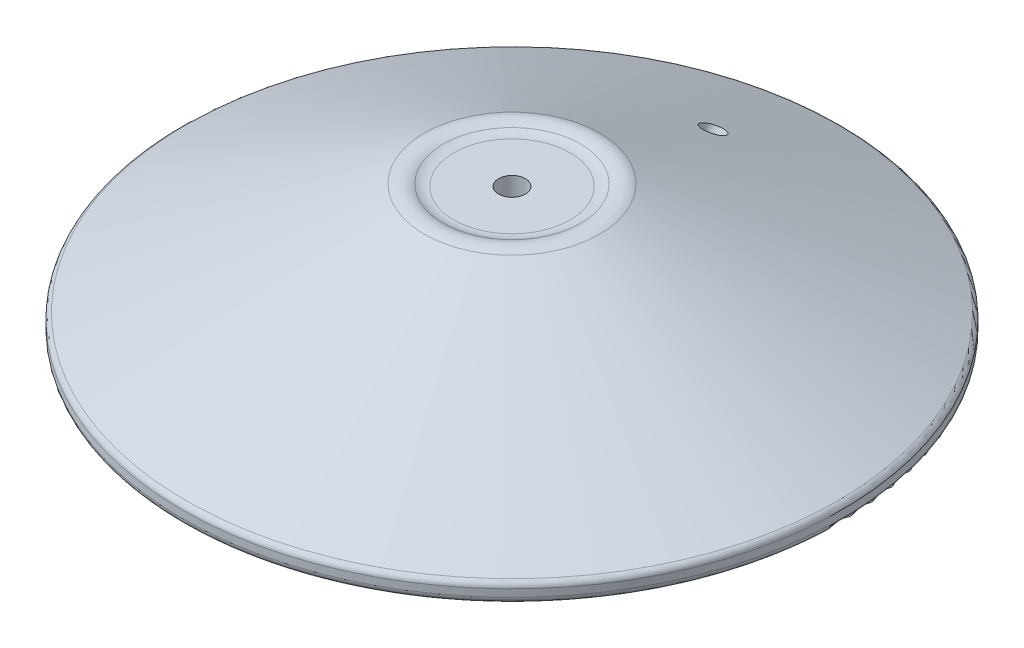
from build123d import *

# Parameters (mm, degrees)
DIAM_TRE_DU_PER_AGE_10_0_10_1_D     = 10
DIAM_TRE_DU_PER_AGE_10_0_10_1_DEPTH = 10
DIAM_TRE_DU_PER_AGE_10_0_10_1_TIP   = 3.004303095
CHANFREIN1_SIZE                     = 3


with BuildPart() as part:
    # Esquisse1 → R_volution1 (revolve)
    with BuildSketch(Plane.XY, mode=Mode.PRIVATE) as r_volution1_sk:
        with BuildLine():
            Line((6, 0), (144.5, 0))
            ThreePointArc((144.5, 0), (146.621320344, 0.878679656), (147.5, 3))
            Line((147.5, 3), (147.5, 6.284779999))
            ThreePointArc((147.5, 6.284779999), (147.032518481, 7.892993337), (145.775766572, 9))
            Line((145.775766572, 9), (39.252555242, 59.050733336))
            ThreePointArc((39.252555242, 59.050733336), (35, 60), (30.747444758, 59.050733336))
            ThreePointArc((30.747444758, 59.050733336), (28.451814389, 58.265876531), (26.040335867, 58))
            Line((26.040335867, 58), (6, 58))
            Line((6, 58), (6, 0))
        make_face()
    revolve(r_volution1_sk.sketch.rotate(Axis((0, 0, 0), (0, 1, 0)), 90), axis=Axis((0, 0, 0), (0, 1, 0)))

    # Diam_tre du per_age _10.0 _10_1
    with Locations(Plane(origin=(0, 35.206664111, -90), x_dir=(0, 0.425255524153, 0.905073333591), z_dir=(0, 0.905073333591, -0.425255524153))):
        with Locations((0, 0)):
            Hole(DIAM_TRE_DU_PER_AGE_10_0_10_1_D / 2, depth=DIAM_TRE_DU_PER_AGE_10_0_10_1_DEPTH)
            with Locations((0, 0, -(DIAM_TRE_DU_PER_AGE_10_0_10_1_DEPTH + DIAM_TRE_DU_PER_AGE_10_0_10_1_TIP / 2))):  # 118° drill point
                Cone(0, DIAM_TRE_DU_PER_AGE_10_0_10_1_D / 2, DIAM_TRE_DU_PER_AGE_10_0_10_1_TIP, mode=Mode.SUBTRACT)

    # Chanfrein1
    chanfrein1_edges = [part.edges().sort_by_distance(p)[0] for p in [
        (0, 0, 6),
    ]]
    chamfer(chanfrein1_edges, length=CHANFREIN1_SIZE)


solid = part.part
